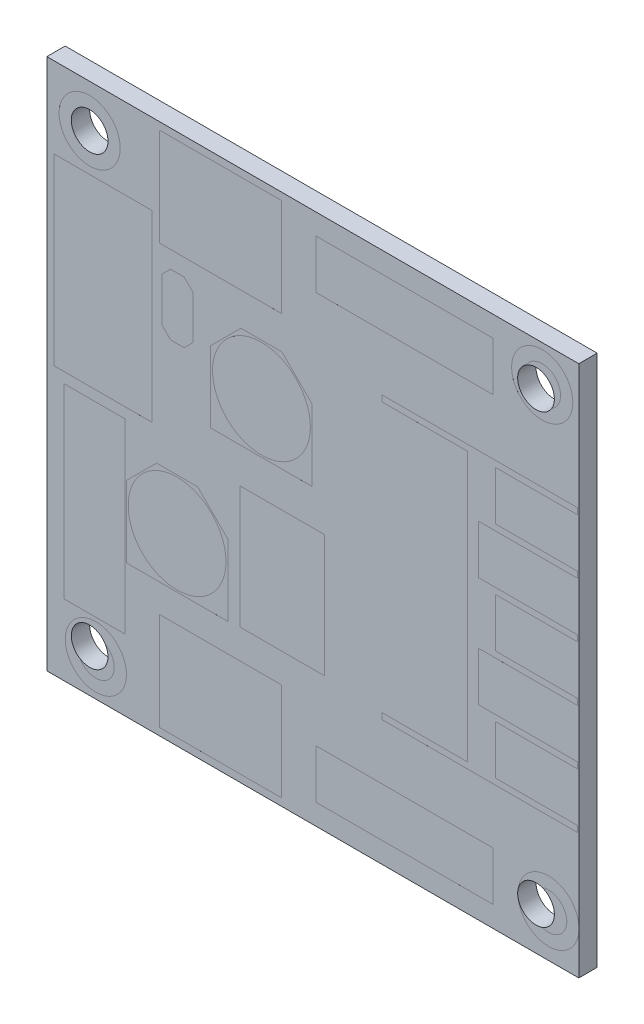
from build123d import *

# Parameters (mm, degrees)
SKETCH1_W           = 43.5
SKETCH1_H           = 43.5
SKETCH1_R           = 1.5
BOSS_EXTRUDE1_DEPTH = 1.5
CUT_EXTRUDE1_START  = -0.0001
SKETCH2_R           = 2.5
SKETCH2_R_2         = 1.5
CUT_EXTRUDE1_DEPTH  = 0.0001
SKETCH3_R           = 2.5
SKETCH3_R_2         = 1.5
CUT_EXTRUDE2_DEPTH  = 0.002
SKETCH4_W           = 7
SKETCH4_H           = 0.5
CUT_EXTRUDE4_DEPTH  = 0.0001
SKETCH6_W           = 8
SKETCH6_H           = 15
SKETCH6_W_2         = 10
SKETCH6_H_2         = 8
CUT_EXTRUDE5_DEPTH  = 0.0001
SKETCH8_R           = 4
CUT_EXTRUDE6_DEPTH  = 0.0001
SKETCH9_W           = 14.5
SKETCH9_H           = 4
CUT_EXTRUDE7_DEPTH  = 0.0001
SKETCH10_W          = 5
SKETCH10_H          = 15.24
CUT_EXTRUDE8_DEPTH  = 0.0001
SKETCH11_R          = 4
SKETCH11_W          = 14.5
SKETCH11_H          = 4
CUT_EXTRUDE9_DEPTH  = 0.0001
CUT_EXTRUDE10_DEPTH = 0.0001
SKETCH13_W          = 6.9
SKETCH13_H          = 10
CUT_EXTRUDE11_DEPTH = 0.0001


with BuildPart() as part:
    # Sketch1 → Boss-Extrude1 (new body)
    with BuildSketch(Plane.XY):
        Rectangle(SKETCH1_W, SKETCH1_H)
        with Locations((-18.25, 18.25)):
            Circle(SKETCH1_R, mode=Mode.SUBTRACT)
        with Locations((18.25, 18.25)):
            Circle(SKETCH1_R, mode=Mode.SUBTRACT)
        with Locations((18.25, -18.25)):
            Circle(SKETCH1_R, mode=Mode.SUBTRACT)
        with Locations((-18.25, -18.25)):
            Circle(SKETCH1_R, mode=Mode.SUBTRACT)
    extrude(amount=BOSS_EXTRUDE1_DEPTH)

    # Sketch2 → Cut-Extrude1 (cut)
    # profile 1 of 4: a face of its own
    with BuildSketch(Plane.XY.offset(1.5).offset(CUT_EXTRUDE1_START)):
        with Locations((-18.25, 18.25)):
            Circle(SKETCH2_R)
        with Locations((-18.25, 18.25)):
            Circle(SKETCH2_R_2, mode=Mode.SUBTRACT)
    # profile 2 of 4: a face of its own
    with BuildSketch(Plane.XY.offset(1.5).offset(CUT_EXTRUDE1_START)):
        with Locations((18.758938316, 18.758938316)):
            Circle(SKETCH2_R)
        with Locations((18.758938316, 18.758938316)):
            Circle(SKETCH2_R_2, mode=Mode.SUBTRACT)
    # profile 3 of 4: a face of its own
    with BuildSketch(Plane.XY.offset(1.5).offset(CUT_EXTRUDE1_START)):
        with Locations((19.267876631, -18.25)):
            Circle(SKETCH2_R)
        with Locations((19.267876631, -18.25)):
            Circle(SKETCH2_R_2, mode=Mode.SUBTRACT)
    # profile 4 of 4: a face of its own
    with BuildSketch(Plane.XY.offset(1.5).offset(CUT_EXTRUDE1_START)):
        with Locations((-17.741061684, -18.758938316)):
            Circle(SKETCH2_R)
        with Locations((-17.741061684, -18.758938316)):
            Circle(SKETCH2_R_2, mode=Mode.SUBTRACT)
    extrude(amount=CUT_EXTRUDE1_DEPTH, mode=Mode.SUBTRACT)

    # Sketch3 → Cut-Extrude2 (cut)
    # profile 1 of 4: a face of its own
    with BuildSketch(Plane(origin=(0, 0, 0), x_dir=(-1, 0, 0), z_dir=(0, 0, -1))):
        with Locations((-18.25, -18.25)):
            Circle(SKETCH3_R)
        with Locations((-18.25, -18.25)):
            Circle(SKETCH3_R_2, mode=Mode.SUBTRACT)
    # profile 2 of 4: a face of its own
    with BuildSketch(Plane(origin=(0, 0, 0), x_dir=(-1, 0, 0), z_dir=(0, 0, -1))):
        with Locations(Location((-18.758938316, 18.758938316, 0), (0, 0, 180))):
            Circle(SKETCH3_R)
        with Locations((-18.758938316, 18.758938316)):
            Circle(SKETCH3_R_2, mode=Mode.SUBTRACT)
    # profile 3 of 4: a face of its own
    with BuildSketch(Plane(origin=(0, 0, 0), x_dir=(-1, 0, 0), z_dir=(0, 0, -1))):
        with Locations((18.25, 19.267876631)):
            Circle(SKETCH3_R)
        with Locations((18.25, 19.267876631)):
            Circle(SKETCH3_R_2, mode=Mode.SUBTRACT)
    # profile 4 of 4: a face of its own
    with BuildSketch(Plane(origin=(0, 0, 0), x_dir=(-1, 0, 0), z_dir=(0, 0, -1))):
        with Locations((18.758938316, -17.741061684)):
            Circle(SKETCH3_R)
        with Locations((18.758938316, -17.741061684)):
            Circle(SKETCH3_R_2, mode=Mode.SUBTRACT)
    extrude(amount=-CUT_EXTRUDE2_DEPTH, mode=Mode.SUBTRACT)

    # Sketch4 → Cut-Extrude4 (cut)
    with BuildSketch(Plane.XY.offset(1.5)):
        Polygon((14.95, 11), (21.65, 11), (21.65, 11.5), (12.65, 11.5), (12.65, 11), (12.65, -11), (12.65, -11.5), (21.65, -11.5), (21.65, -11), (14.95, -11), (14.95, -7), (21.65, -7), (21.65, -6.5), (13.55, -6.5), (13.55, -2.5), (21.65, -2.5), (21.65, -2), (14.95, -2), (14.95, 2), (21.65, 2), (21.65, 2.5), (13.55, 2.5), (13.55, 6.5), (21.65, 6.5), (21.65, 7), (14.95, 7), align=None)
        with Locations((9.15, 11.25)):
            Rectangle(SKETCH4_W, SKETCH4_H)
        with Locations((9.15, -11.25)):
            Rectangle(SKETCH4_W, SKETCH4_H)
    extrude(amount=-CUT_EXTRUDE4_DEPTH, mode=Mode.SUBTRACT)

    # Sketch6 → Cut-Extrude5 (cut)
    with BuildSketch(Plane.XY.offset(1.5)):
        with Locations((-17.15, 7.65)):
            Rectangle(SKETCH6_W, SKETCH6_H)
        with Locations((-7.55, 17.15)):
            Rectangle(SKETCH6_W_2, SKETCH6_H_2)
        with Locations((-7.55, -17.15)):
            Rectangle(SKETCH6_W_2, SKETCH6_H_2)
    extrude(amount=-CUT_EXTRUDE5_DEPTH, mode=Mode.SUBTRACT)

    # Sketch8 → Cut-Extrude6 (cut)
    with BuildSketch(Plane.XY.offset(1.5)):
        Polygon((-0.05, 7.98), (-2.52, 10.45), (-5.88, 10.45), (-8.35, 7.98), (-8.35, 2.15), (-0.05, 2.15), align=None)
        with Locations((-4.2, 6.3)):
            Circle(SKETCH8_R, mode=Mode.SUBTRACT)
    extrude(amount=-CUT_EXTRUDE6_DEPTH, mode=Mode.SUBTRACT)

    # Sketch9 → Cut-Extrude7 (cut)
    with BuildSketch(Plane.XY.offset(1.5)):
        with Locations((7.5, 18.05)):
            Rectangle(SKETCH9_W, SKETCH9_H)
    extrude(amount=-CUT_EXTRUDE7_DEPTH, mode=Mode.SUBTRACT)

    # Sketch10 → Cut-Extrude8 (cut)
    with BuildSketch(Plane.XY.offset(1.5)):
        with Locations((-17.85, -8.33)):
            Rectangle(SKETCH10_W, SKETCH10_H)
    extrude(amount=-CUT_EXTRUDE8_DEPTH, mode=Mode.SUBTRACT)

    # Sketch11 → Cut-Extrude9 (cut)
    # profile 1 of 2: a face of its own
    with BuildSketch(Plane.XY.offset(1.5)):
        Polygon((-9.42, -2.55), (-12.78, -2.55), (-15.25, -5.02), (-15.25, -10.85), (-6.95, -10.85), (-6.95, -5.02), align=None)
        with Locations((-11.1, -6.7)):
            Circle(SKETCH11_R, mode=Mode.SUBTRACT)
    # profile 2 of 2: a face of its own
    with BuildSketch(Plane.XY.offset(1.5)):
        with Locations((7.5, -18.05)):
            Rectangle(SKETCH11_W, SKETCH11_H)
    extrude(amount=-CUT_EXTRUDE9_DEPTH, mode=Mode.SUBTRACT)

    # Sketch12 → Cut-Extrude10 (cut)
    with BuildSketch(Plane.XY.offset(1.5)):
        Polygon((-9.81, 11.04), (-10.52, 11.75), (-11.64, 11.75), (-12.35, 11.04), (-12.35, 7.46), (-11.64, 6.75), (-10.52, 6.75), (-9.81, 7.46), align=None)
    extrude(amount=-CUT_EXTRUDE10_DEPTH, mode=Mode.SUBTRACT)

    # Sketch13 → Cut-Extrude11 (cut)
    with BuildSketch(Plane.XY.offset(1.5)):
        with Locations((-2.5, -5.75)):
            Rectangle(SKETCH13_W, SKETCH13_H)
    extrude(amount=-CUT_EXTRUDE11_DEPTH, mode=Mode.SUBTRACT)


solid = part.part
